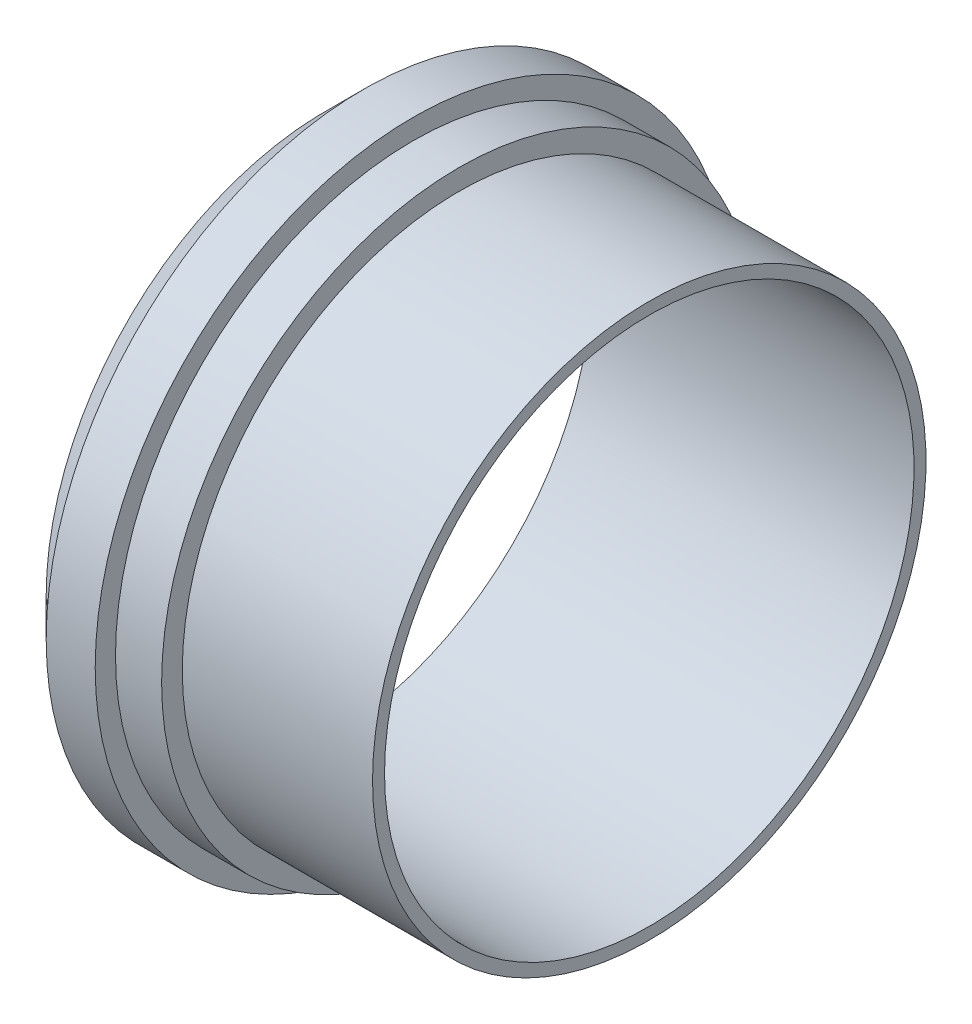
ISO-10303-21;
HEADER;
FILE_DESCRIPTION(('STEP AP214'),'2;1');
FILE_NAME('part.step','',(''),(''),'','','');
FILE_SCHEMA(('AUTOMOTIVE_DESIGN { 1 0 10303 214 1 1 1 1 }'));
ENDSEC;
DATA;
#1=APPLICATION_CONTEXT('core data for automotive mechanical design processes');
#2=APPLICATION_PROTOCOL_DEFINITION('international standard','automotive_design',2000,#1);
#3=PRODUCT_CONTEXT('',#1,'mechanical');
#4=PRODUCT('Part','Part','',(#3));
#5=PRODUCT_RELATED_PRODUCT_CATEGORY('part','',(#4));
#6=PRODUCT_DEFINITION_FORMATION('','',#4);
#7=PRODUCT_DEFINITION_CONTEXT('part definition',#1,'design');
#8=PRODUCT_DEFINITION('design','',#6,#7);
#9=PRODUCT_DEFINITION_SHAPE('','',#8);
#10=(LENGTH_UNIT() NAMED_UNIT(*) SI_UNIT(.MILLI.,.METRE.));
#11=(NAMED_UNIT(*) PLANE_ANGLE_UNIT() SI_UNIT($,.RADIAN.));
#12=(NAMED_UNIT(*) SI_UNIT($,.STERADIAN.) SOLID_ANGLE_UNIT());
#13=UNCERTAINTY_MEASURE_WITH_UNIT(LENGTH_MEASURE(1.E-05),#10,'distance_accuracy_value','');
#14=(GEOMETRIC_REPRESENTATION_CONTEXT(3) GLOBAL_UNCERTAINTY_ASSIGNED_CONTEXT((#13)) GLOBAL_UNIT_ASSIGNED_CONTEXT((#10,
#11,#12)) REPRESENTATION_CONTEXT('',''));
#15=CARTESIAN_POINT('',(0.,0.,0.));
#16=DIRECTION('',(0.,0.,1.));
#17=DIRECTION('',(1.,0.,0.));
#18=AXIS2_PLACEMENT_3D('',#15,#16,#17);
#19=CARTESIAN_POINT('',(0.,38.1,0.));
#20=DIRECTION('',(1.,0.,0.));
#21=DIRECTION('',(0.,0.,-1.));
#22=AXIS2_PLACEMENT_3D('',#19,#20,#21);
#23=PLANE('',#22);
#24=CARTESIAN_POINT('',(0.,38.1,0.));
#25=DIRECTION('',(-1.,0.,0.));
#26=DIRECTION('',(0.,0.,1.));
#27=AXIS2_PLACEMENT_3D('',#24,#25,#26);
#28=CIRCLE('',#27,36.449);
#29=CARTESIAN_POINT('',(0.,38.1,36.449));
#30=VERTEX_POINT('',#29);
#31=EDGE_CURVE('E59',#30,#30,#28,.T.);
#32=ORIENTED_EDGE('',*,*,#31,.T.);
#33=EDGE_LOOP('',(#32));
#34=FACE_BOUND('',#33,.T.);
#35=CARTESIAN_POINT('',(0.,38.1,0.));
#36=DIRECTION('',(-1.,0.,0.));
#37=DIRECTION('',(0.,0.,1.));
#38=AXIS2_PLACEMENT_3D('',#35,#36,#37);
#39=CIRCLE('',#38,38.1);
#40=CARTESIAN_POINT('',(0.,38.1,38.1));
#41=VERTEX_POINT('',#40);
#42=EDGE_CURVE('E10',#41,#41,#39,.T.);
#43=ORIENTED_EDGE('',*,*,#42,.F.);
#44=EDGE_LOOP('',(#43));
#45=FACE_BOUND('',#44,.T.);
#46=ADVANCED_FACE('F31',(#34,#45),#23,.T.);
#47=CARTESIAN_POINT('',(-44.45,38.1,0.));
#48=DIRECTION('',(-1.,0.,0.));
#49=DIRECTION('',(0.,0.,1.));
#50=AXIS2_PLACEMENT_3D('',#47,#48,#49);
#51=CYLINDRICAL_SURFACE('',#50,38.1);
#52=ORIENTED_EDGE('',*,*,#42,.T.);
#53=EDGE_LOOP('',(#52));
#54=FACE_BOUND('',#53,.T.);
#55=CARTESIAN_POINT('',(-26.19248,38.1,0.));
#56=DIRECTION('',(-1.,0.,0.));
#57=DIRECTION('',(0.,0.,1.));
#58=AXIS2_PLACEMENT_3D('',#55,#56,#57);
#59=CIRCLE('',#58,38.1);
#60=CARTESIAN_POINT('',(-26.19248,38.1,38.1));
#61=VERTEX_POINT('',#60);
#62=EDGE_CURVE('E37',#61,#61,#59,.T.);
#63=ORIENTED_EDGE('',*,*,#62,.F.);
#64=EDGE_LOOP('',(#63));
#65=FACE_BOUND('',#64,.T.);
#66=ADVANCED_FACE('F92',(#54,#65),#51,.T.);
#67=CARTESIAN_POINT('',(-26.19248,0.,0.));
#68=DIRECTION('',(1.,0.,0.));
#69=DIRECTION('',(0.,0.,-1.));
#70=AXIS2_PLACEMENT_3D('',#67,#68,#69);
#71=PLANE('',#70);
#72=ORIENTED_EDGE('',*,*,#62,.T.);
#73=EDGE_LOOP('',(#72));
#74=FACE_BOUND('',#73,.T.);
#75=CARTESIAN_POINT('',(-26.19248,38.1,0.));
#76=DIRECTION('',(-1.,0.,0.));
#77=DIRECTION('',(0.,0.,1.));
#78=AXIS2_PLACEMENT_3D('',#75,#76,#77);
#79=CIRCLE('',#78,40.9448);
#80=CARTESIAN_POINT('',(-26.19248,38.1,40.9448));
#81=VERTEX_POINT('',#80);
#82=EDGE_CURVE('E41',#81,#81,#79,.T.);
#83=ORIENTED_EDGE('',*,*,#82,.F.);
#84=EDGE_LOOP('',(#83));
#85=FACE_BOUND('',#84,.T.);
#86=ADVANCED_FACE('F96',(#74,#85),#71,.T.);
#87=CARTESIAN_POINT('',(-44.45,38.1,0.));
#88=DIRECTION('',(-1.,0.,0.));
#89=DIRECTION('',(0.,0.,1.));
#90=AXIS2_PLACEMENT_3D('',#87,#88,#89);
#91=CYLINDRICAL_SURFACE('',#90,40.9448);
#92=ORIENTED_EDGE('',*,*,#82,.T.);
#93=EDGE_LOOP('',(#92));
#94=FACE_BOUND('',#93,.T.);
#95=CARTESIAN_POINT('',(-32.54248,38.1,0.));
#96=DIRECTION('',(-1.,0.,0.));
#97=DIRECTION('',(0.,0.,1.));
#98=AXIS2_PLACEMENT_3D('',#95,#96,#97);
#99=CIRCLE('',#98,40.9448);
#100=CARTESIAN_POINT('',(-32.54248,38.1,40.9448));
#101=VERTEX_POINT('',#100);
#102=EDGE_CURVE('E45',#101,#101,#99,.T.);
#103=ORIENTED_EDGE('',*,*,#102,.F.);
#104=EDGE_LOOP('',(#103));
#105=FACE_BOUND('',#104,.T.);
#106=ADVANCED_FACE('F100',(#94,#105),#91,.T.);
#107=CARTESIAN_POINT('',(-32.54248,-2.84480000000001,0.));
#108=DIRECTION('',(1.,0.,0.));
#109=DIRECTION('',(0.,0.,-1.));
#110=AXIS2_PLACEMENT_3D('',#107,#108,#109);
#111=PLANE('',#110);
#112=ORIENTED_EDGE('',*,*,#102,.T.);
#113=EDGE_LOOP('',(#112));
#114=FACE_BOUND('',#113,.T.);
#115=CARTESIAN_POINT('',(-32.54248,38.1,0.));
#116=DIRECTION('',(-1.,0.,0.));
#117=DIRECTION('',(0.,0.,1.));
#118=AXIS2_PLACEMENT_3D('',#115,#116,#117);
#119=CIRCLE('',#118,43.7388);
#120=CARTESIAN_POINT('',(-32.54248,38.1,43.7388));
#121=VERTEX_POINT('',#120);
#122=EDGE_CURVE('E50',#121,#121,#119,.T.);
#123=ORIENTED_EDGE('',*,*,#122,.F.);
#124=EDGE_LOOP('',(#123));
#125=FACE_BOUND('',#124,.T.);
#126=ADVANCED_FACE('F88',(#114,#125),#111,.T.);
#127=CARTESIAN_POINT('',(-44.45,38.1,0.));
#128=DIRECTION('',(-1.,0.,0.));
#129=DIRECTION('',(0.,0.,1.));
#130=AXIS2_PLACEMENT_3D('',#127,#128,#129);
#131=CYLINDRICAL_SURFACE('',#130,43.7388);
#132=ORIENTED_EDGE('',*,*,#122,.T.);
#133=EDGE_LOOP('',(#132));
#134=FACE_BOUND('',#133,.T.);
#135=CARTESIAN_POINT('',(-39.29126,38.1,0.));
#136=DIRECTION('',(-1.,0.,0.));
#137=DIRECTION('',(0.,0.,1.));
#138=AXIS2_PLACEMENT_3D('',#135,#136,#137);
#139=CIRCLE('',#138,43.7388);
#140=CARTESIAN_POINT('',(-39.29126,38.1,43.7388));
#141=VERTEX_POINT('',#140);
#142=EDGE_CURVE('E53',#141,#141,#139,.T.);
#143=ORIENTED_EDGE('',*,*,#142,.F.);
#144=EDGE_LOOP('',(#143));
#145=FACE_BOUND('',#144,.T.);
#146=ADVANCED_FACE('F82',(#134,#145),#131,.T.);
#147=CARTESIAN_POINT('',(-44.45,38.1,0.));
#148=DIRECTION('',(1.,0.,0.));
#149=DIRECTION('',(0.,0.,-1.));
#150=AXIS2_PLACEMENT_3D('',#147,#148,#149);
#151=CONICAL_SURFACE('',#150,38.5826,0.785151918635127);
#152=ORIENTED_EDGE('',*,*,#142,.T.);
#153=EDGE_LOOP('',(#152));
#154=FACE_BOUND('',#153,.T.);
#155=CARTESIAN_POINT('',(-44.45,38.1,0.));
#156=DIRECTION('',(-1.,0.,0.));
#157=DIRECTION('',(0.,0.,1.));
#158=AXIS2_PLACEMENT_3D('',#155,#156,#157);
#159=CIRCLE('',#158,38.5826);
#160=CARTESIAN_POINT('',(-44.45,38.1,38.5826));
#161=VERTEX_POINT('',#160);
#162=EDGE_CURVE('E56',#161,#161,#159,.T.);
#163=ORIENTED_EDGE('',*,*,#162,.F.);
#164=EDGE_LOOP('',(#163));
#165=FACE_BOUND('',#164,.T.);
#166=ADVANCED_FACE('F77',(#154,#165),#151,.T.);
#167=CARTESIAN_POINT('',(-44.45,-0.482599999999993,0.));
#168=DIRECTION('',(-1.,0.,0.));
#169=DIRECTION('',(0.,0.,1.));
#170=AXIS2_PLACEMENT_3D('',#167,#168,#169);
#171=PLANE('',#170);
#172=CARTESIAN_POINT('',(-44.45,38.1,0.));
#173=DIRECTION('',(-1.,0.,0.));
#174=DIRECTION('',(0.,0.,1.));
#175=AXIS2_PLACEMENT_3D('',#172,#173,#174);
#176=CIRCLE('',#175,36.449);
#177=CARTESIAN_POINT('',(-44.45,38.1,36.449));
#178=VERTEX_POINT('',#177);
#179=EDGE_CURVE('E60',#178,#178,#176,.T.);
#180=ORIENTED_EDGE('',*,*,#179,.F.);
#181=EDGE_LOOP('',(#180));
#182=FACE_BOUND('',#181,.T.);
#183=ORIENTED_EDGE('',*,*,#162,.T.);
#184=EDGE_LOOP('',(#183));
#185=FACE_BOUND('',#184,.T.);
#186=ADVANCED_FACE('F71',(#182,#185),#171,.T.);
#187=CARTESIAN_POINT('',(0.,38.1,0.));
#188=DIRECTION('',(-1.,0.,0.));
#189=DIRECTION('',(0.,0.,1.));
#190=AXIS2_PLACEMENT_3D('',#187,#188,#189);
#191=CYLINDRICAL_SURFACE('',#190,36.449);
#192=ORIENTED_EDGE('',*,*,#31,.F.);
#193=EDGE_LOOP('',(#192));
#194=FACE_BOUND('',#193,.T.);
#195=ORIENTED_EDGE('',*,*,#179,.T.);
#196=EDGE_LOOP('',(#195));
#197=FACE_BOUND('',#196,.T.);
#198=ADVANCED_FACE('F68',(#194,#197),#191,.F.);
#199=CLOSED_SHELL('',(#46,#66,#86,#106,#126,#146,#166,#186,#198));
#200=MANIFOLD_SOLID_BREP('B2',#199);
#201=ADVANCED_BREP_SHAPE_REPRESENTATION('',(#18,#200),#14);
#202=SHAPE_DEFINITION_REPRESENTATION(#9,#201);
ENDSEC;
END-ISO-10303-21;
